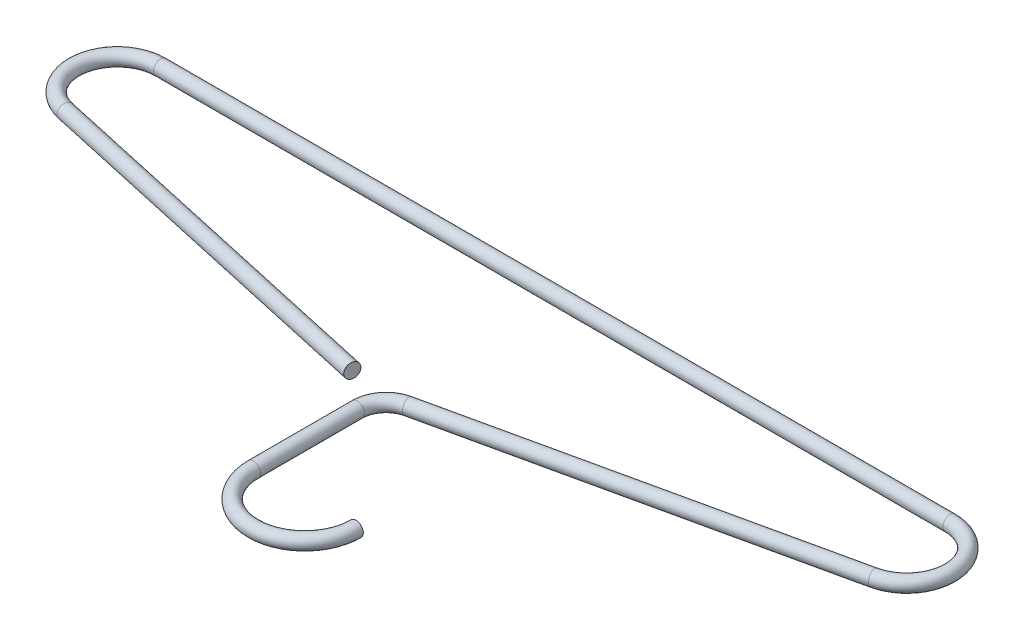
ISO-10303-21;
HEADER;
FILE_DESCRIPTION(('STEP AP214'),'2;1');
FILE_NAME('part.step','',(''),(''),'','','');
FILE_SCHEMA(('AUTOMOTIVE_DESIGN { 1 0 10303 214 1 1 1 1 }'));
ENDSEC;
DATA;
#1=APPLICATION_CONTEXT('core data for automotive mechanical design processes');
#2=APPLICATION_PROTOCOL_DEFINITION('international standard','automotive_design',2000,#1);
#3=PRODUCT_CONTEXT('',#1,'mechanical');
#4=PRODUCT('Part','Part','',(#3));
#5=PRODUCT_RELATED_PRODUCT_CATEGORY('part','',(#4));
#6=PRODUCT_DEFINITION_FORMATION('','',#4);
#7=PRODUCT_DEFINITION_CONTEXT('part definition',#1,'design');
#8=PRODUCT_DEFINITION('design','',#6,#7);
#9=PRODUCT_DEFINITION_SHAPE('','',#8);
#10=(LENGTH_UNIT() NAMED_UNIT(*) SI_UNIT(.MILLI.,.METRE.));
#11=(NAMED_UNIT(*) PLANE_ANGLE_UNIT() SI_UNIT($,.RADIAN.));
#12=(NAMED_UNIT(*) SI_UNIT($,.STERADIAN.) SOLID_ANGLE_UNIT());
#13=UNCERTAINTY_MEASURE_WITH_UNIT(LENGTH_MEASURE(1.E-05),#10,'distance_accuracy_value','');
#14=(GEOMETRIC_REPRESENTATION_CONTEXT(3) GLOBAL_UNCERTAINTY_ASSIGNED_CONTEXT((#13)) GLOBAL_UNIT_ASSIGNED_CONTEXT((#10,
#11,#12)) REPRESENTATION_CONTEXT('',''));
#15=CARTESIAN_POINT('',(0.,0.,0.));
#16=DIRECTION('',(0.,0.,1.));
#17=DIRECTION('',(1.,0.,0.));
#18=AXIS2_PLACEMENT_3D('',#15,#16,#17);
#19=CARTESIAN_POINT('',(22.6085032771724,0.,55.1091565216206));
#20=DIRECTION('',(0.,1.,0.));
#21=DIRECTION('',(0.,0.,1.));
#22=AXIS2_PLACEMENT_3D('',#19,#20,#21);
#23=TOROIDAL_SURFACE('',#22,22.6085032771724,3.175);
#24=CARTESIAN_POINT('',(0.,0.,55.1091565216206));
#25=DIRECTION('',(0.,0.,-1.));
#26=DIRECTION('',(-1.,0.,0.));
#27=AXIS2_PLACEMENT_3D('',#24,#25,#26);
#28=CIRCLE('',#27,3.175);
#29=CARTESIAN_POINT('',(-3.17499999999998,0.,55.1091565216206));
#30=VERTEX_POINT('',#29);
#31=EDGE_CURVE('E30',#30,#30,#28,.T.);
#32=CARTESIAN_POINT('',(45.2170065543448,0.,55.1091565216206));
#33=DIRECTION('',(0.,0.,1.));
#34=DIRECTION('',(1.,0.,0.));
#35=AXIS2_PLACEMENT_3D('',#32,#33,#34);
#36=CIRCLE('',#35,3.175);
#37=CARTESIAN_POINT('',(48.3920065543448,0.,55.1091565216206));
#38=VERTEX_POINT('',#37);
#39=EDGE_CURVE('E10',#38,#38,#36,.T.);
#40=CARTESIAN_POINT('',(22.6085032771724,0.,55.1091565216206));
#41=DIRECTION('',(0.,1.,0.));
#42=DIRECTION('',(0.,0.,1.));
#43=AXIS2_PLACEMENT_3D('',#40,#41,#42);
#44=CIRCLE('',#43,25.7835032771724);
#45=EDGE_CURVE('',#30,#38,#44,.T.);
#46=ORIENTED_EDGE('',*,*,#31,.F.);
#47=ORIENTED_EDGE('',*,*,#39,.T.);
#48=ORIENTED_EDGE('',*,*,#45,.T.);
#49=ORIENTED_EDGE('',*,*,#45,.F.);
#50=EDGE_LOOP('',(#46,#48,#47,#49));
#51=FACE_BOUND('',#50,.T.);
#52=ADVANCED_FACE('F24',(#51),#23,.T.);
#53=CARTESIAN_POINT('',(0.,0.,9.39842947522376));
#54=DIRECTION('',(0.,0.,1.));
#55=DIRECTION('',(1.,0.,0.));
#56=AXIS2_PLACEMENT_3D('',#53,#54,#55);
#57=CYLINDRICAL_SURFACE('',#56,3.175);
#58=CARTESIAN_POINT('',(0.,0.,9.39842947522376));
#59=DIRECTION('',(0.,0.,-1.));
#60=DIRECTION('',(-1.,0.,0.));
#61=AXIS2_PLACEMENT_3D('',#58,#59,#60);
#62=CIRCLE('',#61,3.175);
#63=CARTESIAN_POINT('',(-3.17499999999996,0.,9.39842947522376));
#64=VERTEX_POINT('',#63);
#65=EDGE_CURVE('E34',#64,#64,#62,.T.);
#66=ORIENTED_EDGE('',*,*,#65,.F.);
#67=EDGE_LOOP('',(#66));
#68=FACE_BOUND('',#67,.T.);
#69=ORIENTED_EDGE('',*,*,#31,.T.);
#70=EDGE_LOOP('',(#69));
#71=FACE_BOUND('',#70,.T.);
#72=ADVANCED_FACE('F77',(#68,#71),#57,.T.);
#73=CARTESIAN_POINT('',(12.7,0.,9.39842947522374));
#74=DIRECTION('',(0.,1.,0.));
#75=DIRECTION('',(0.,0.,1.));
#76=AXIS2_PLACEMENT_3D('',#73,#74,#75);
#77=TOROIDAL_SURFACE('',#76,12.7,3.175);
#78=CARTESIAN_POINT('',(9.95719189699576,0.,-3.0018529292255));
#79=DIRECTION('',(0.976400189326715,0.,-0.215969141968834));
#80=DIRECTION('',(-0.215969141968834,0.,-0.976400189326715));
#81=AXIS2_PLACEMENT_3D('',#78,#79,#80);
#82=CIRCLE('',#81,3.175);
#83=CARTESIAN_POINT('',(9.27148987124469,0.,-6.10192353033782));
#84=VERTEX_POINT('',#83);
#85=EDGE_CURVE('E38',#84,#84,#82,.T.);
#86=CARTESIAN_POINT('',(12.7,0.,9.39842947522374));
#87=DIRECTION('',(0.,1.,0.));
#88=DIRECTION('',(0.,0.,1.));
#89=AXIS2_PLACEMENT_3D('',#86,#87,#88);
#90=CIRCLE('',#89,15.875);
#91=EDGE_CURVE('',#84,#64,#90,.T.);
#92=ORIENTED_EDGE('',*,*,#85,.F.);
#93=ORIENTED_EDGE('',*,*,#65,.T.);
#94=ORIENTED_EDGE('',*,*,#91,.T.);
#95=ORIENTED_EDGE('',*,*,#91,.F.);
#96=EDGE_LOOP('',(#92,#94,#93,#95));
#97=FACE_BOUND('',#96,.T.);
#98=ADVANCED_FACE('F82',(#97),#77,.T.);
#99=CARTESIAN_POINT('',(177.807440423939,0.,-40.1285091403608));
#100=DIRECTION('',(-0.976400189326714,0.,0.215969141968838));
#101=DIRECTION('',(0.215969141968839,0.,0.976400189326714));
#102=AXIS2_PLACEMENT_3D('',#99,#100,#101);
#103=CYLINDRICAL_SURFACE('',#102,3.175);
#104=CARTESIAN_POINT('',(177.807440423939,0.,-40.1285091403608));
#105=DIRECTION('',(0.976400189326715,0.,-0.215969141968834));
#106=DIRECTION('',(-0.215969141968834,0.,-0.976400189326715));
#107=AXIS2_PLACEMENT_3D('',#104,#105,#106);
#108=CIRCLE('',#107,3.175);
#109=CARTESIAN_POINT('',(178.493142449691,0.,-37.0284385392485));
#110=VERTEX_POINT('',#109);
#111=EDGE_CURVE('E43',#110,#110,#108,.T.);
#112=ORIENTED_EDGE('',*,*,#111,.F.);
#113=EDGE_LOOP('',(#112));
#114=FACE_BOUND('',#113,.T.);
#115=ORIENTED_EDGE('',*,*,#85,.T.);
#116=EDGE_LOOP('',(#115));
#117=FACE_BOUND('',#116,.T.);
#118=ADVANCED_FACE('F87',(#114,#117),#103,.T.);
#119=CARTESIAN_POINT('',(173.693228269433,0.,-58.7289327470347));
#120=DIRECTION('',(0.,-1.,0.));
#121=DIRECTION('',(0.,0.,-1.));
#122=AXIS2_PLACEMENT_3D('',#119,#120,#121);
#123=TOROIDAL_SURFACE('',#122,19.05,3.175);
#124=CARTESIAN_POINT('',(173.693228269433,0.,-77.7789327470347));
#125=DIRECTION('',(-1.,0.,0.));
#126=DIRECTION('',(0.,0.,1.));
#127=AXIS2_PLACEMENT_3D('',#124,#125,#126);
#128=CIRCLE('',#127,3.175);
#129=CARTESIAN_POINT('',(173.693228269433,0.,-80.9539327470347));
#130=VERTEX_POINT('',#129);
#131=EDGE_CURVE('E46',#130,#130,#128,.T.);
#132=CARTESIAN_POINT('',(173.693228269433,0.,-58.7289327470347));
#133=DIRECTION('',(0.,-1.,0.));
#134=DIRECTION('',(0.,0.,-1.));
#135=AXIS2_PLACEMENT_3D('',#132,#133,#134);
#136=CIRCLE('',#135,22.225);
#137=EDGE_CURVE('',#130,#110,#136,.T.);
#138=ORIENTED_EDGE('',*,*,#131,.F.);
#139=ORIENTED_EDGE('',*,*,#111,.T.);
#140=ORIENTED_EDGE('',*,*,#137,.T.);
#141=ORIENTED_EDGE('',*,*,#137,.F.);
#142=EDGE_LOOP('',(#138,#140,#139,#141));
#143=FACE_BOUND('',#142,.T.);
#144=ADVANCED_FACE('F94',(#143),#123,.T.);
#145=CARTESIAN_POINT('',(-173.693228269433,0.,-77.7789327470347));
#146=DIRECTION('',(1.,0.,0.));
#147=DIRECTION('',(0.,0.,-1.));
#148=AXIS2_PLACEMENT_3D('',#145,#146,#147);
#149=CYLINDRICAL_SURFACE('',#148,3.175);
#150=CARTESIAN_POINT('',(-173.693228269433,0.,-77.7789327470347));
#151=DIRECTION('',(-1.,0.,0.));
#152=DIRECTION('',(0.,0.,1.));
#153=AXIS2_PLACEMENT_3D('',#150,#151,#152);
#154=CIRCLE('',#153,3.175);
#155=CARTESIAN_POINT('',(-173.693228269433,0.,-80.9539327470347));
#156=VERTEX_POINT('',#155);
#157=EDGE_CURVE('E49',#156,#156,#154,.T.);
#158=ORIENTED_EDGE('',*,*,#157,.F.);
#159=EDGE_LOOP('',(#158));
#160=FACE_BOUND('',#159,.T.);
#161=ORIENTED_EDGE('',*,*,#131,.T.);
#162=EDGE_LOOP('',(#161));
#163=FACE_BOUND('',#162,.T.);
#164=ADVANCED_FACE('F73',(#160,#163),#149,.T.);
#165=CARTESIAN_POINT('',(-173.693228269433,0.,-58.7289327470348));
#166=DIRECTION('',(0.,-1.,0.));
#167=DIRECTION('',(0.,0.,-1.));
#168=AXIS2_PLACEMENT_3D('',#165,#166,#167);
#169=TOROIDAL_SURFACE('',#168,19.05,3.175);
#170=CARTESIAN_POINT('',(-177.807440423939,0.,-40.1285091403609));
#171=DIRECTION('',(0.976400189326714,0.,0.215969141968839));
#172=DIRECTION('',(0.215969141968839,0.,-0.976400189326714));
#173=AXIS2_PLACEMENT_3D('',#170,#171,#172);
#174=CIRCLE('',#173,3.175);
#175=CARTESIAN_POINT('',(-178.493142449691,0.,-37.0284385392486));
#176=VERTEX_POINT('',#175);
#177=EDGE_CURVE('E52',#176,#176,#174,.T.);
#178=CARTESIAN_POINT('',(-173.693228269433,0.,-58.7289327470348));
#179=DIRECTION('',(0.,-1.,0.));
#180=DIRECTION('',(0.,0.,-1.));
#181=AXIS2_PLACEMENT_3D('',#178,#179,#180);
#182=CIRCLE('',#181,22.225);
#183=EDGE_CURVE('',#176,#156,#182,.T.);
#184=ORIENTED_EDGE('',*,*,#177,.F.);
#185=ORIENTED_EDGE('',*,*,#157,.T.);
#186=ORIENTED_EDGE('',*,*,#183,.T.);
#187=ORIENTED_EDGE('',*,*,#183,.F.);
#188=EDGE_LOOP('',(#184,#186,#185,#187));
#189=FACE_BOUND('',#188,.T.);
#190=ADVANCED_FACE('F64',(#189),#169,.T.);
#191=CARTESIAN_POINT('',(-177.807440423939,0.,-40.1285091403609));
#192=DIRECTION('',(0.976400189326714,0.,0.215969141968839));
#193=DIRECTION('',(0.215969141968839,0.,-0.976400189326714));
#194=AXIS2_PLACEMENT_3D('',#191,#192,#193);
#195=CYLINDRICAL_SURFACE('',#194,3.175);
#196=ORIENTED_EDGE('',*,*,#177,.T.);
#197=EDGE_LOOP('',(#196));
#198=FACE_BOUND('',#197,.T.);
#199=CARTESIAN_POINT('',(-15.8778291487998,0.,-4.31143373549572));
#200=DIRECTION('',(0.976400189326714,0.,0.215969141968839));
#201=DIRECTION('',(0.215969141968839,0.,-0.976400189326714));
#202=AXIS2_PLACEMENT_3D('',#199,#200,#201);
#203=CIRCLE('',#202,3.175);
#204=CARTESIAN_POINT('',(-15.1921271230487,0.,-7.41150433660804));
#205=VERTEX_POINT('',#204);
#206=EDGE_CURVE('E55',#205,#205,#203,.T.);
#207=ORIENTED_EDGE('',*,*,#206,.F.);
#208=EDGE_LOOP('',(#207));
#209=FACE_BOUND('',#208,.T.);
#210=ADVANCED_FACE('F61',(#198,#209),#195,.T.);
#211=CARTESIAN_POINT('',(45.2170065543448,0.,55.1091565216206));
#212=DIRECTION('',(0.,0.,1.));
#213=DIRECTION('',(1.,0.,0.));
#214=AXIS2_PLACEMENT_3D('',#211,#212,#213);
#215=PLANE('',#214);
#216=ORIENTED_EDGE('',*,*,#39,.F.);
#217=EDGE_LOOP('',(#216));
#218=FACE_BOUND('',#217,.T.);
#219=ADVANCED_FACE('F63',(#218),#215,.F.);
#220=CARTESIAN_POINT('',(-15.8778291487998,0.,-4.31143373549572));
#221=DIRECTION('',(0.976400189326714,0.,0.215969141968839));
#222=DIRECTION('',(0.215969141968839,0.,-0.976400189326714));
#223=AXIS2_PLACEMENT_3D('',#220,#221,#222);
#224=PLANE('',#223);
#225=ORIENTED_EDGE('',*,*,#206,.T.);
#226=EDGE_LOOP('',(#225));
#227=FACE_BOUND('',#226,.T.);
#228=ADVANCED_FACE('F59',(#227),#224,.T.);
#229=CLOSED_SHELL('',(#52,#72,#98,#118,#144,#164,#190,#210,#219,#228));
#230=MANIFOLD_SOLID_BREP('B2',#229);
#231=ADVANCED_BREP_SHAPE_REPRESENTATION('',(#18,#230),#14);
#232=SHAPE_DEFINITION_REPRESENTATION(#9,#231);
ENDSEC;
END-ISO-10303-21;
